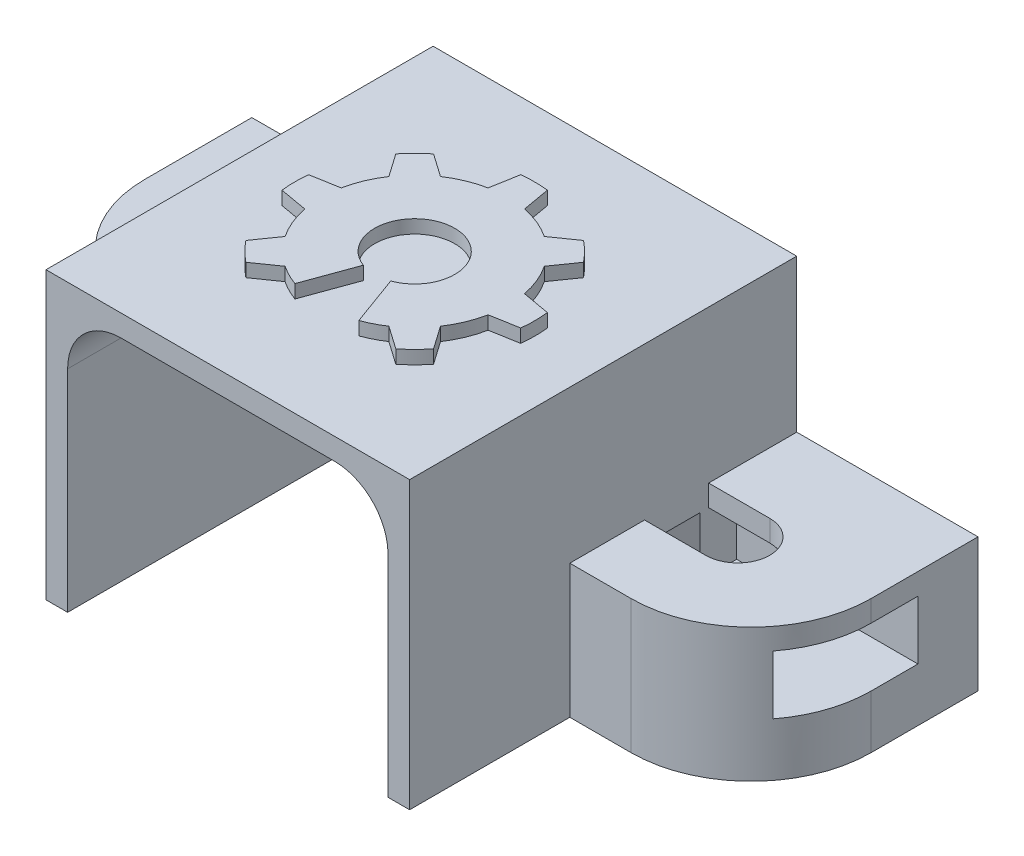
from build123d import *

# Parameters (mm, degrees)
BOSS_EXTRUDE1_DEPTH = 5
FILLET2_R           = 2
BOSS_EXTRUDE3_DEPTH = 9.5
BOSS_EXTRUDE2_DEPTH = 5
CUT_EXTRUDE1_START  = 2
CUT_EXTRUDE1_DEPTH  = 2.2
BOSS_EXTRUDE5_DEPTH = 0.5
SKETCH7_W           = 4.5
SKETCH7_H           = 2.2
CUT_EXTRUDE3_DEPTH  = 6.79
SKETCH8_W           = 4.5
SKETCH8_H           = 2.2
CUT_EXTRUDE4_DEPTH  = 6.79


with BuildPart() as part:
    # Sketch1 → Boss-Extrude1 (new body)
    with BuildSketch(Plane.XY):
        Polygon((6, 0), (6, 9.9), (-6, 9.9), (-6, 0), (-6.81, 0), (-6.81, 10.71), (6.81, 10.71), (6.81, 0), align=None)
    extrude(amount=BOSS_EXTRUDE1_DEPTH)

    # Fillet2
    fillet2_edges = [part.edges().sort_by_distance(p)[0] for p in [
        (6, 9.9, 2.5),
        (-6, 9.9, 2.5),
    ]]
    fillet(fillet2_edges, radius=FILLET2_R)

    # Sketch3 → Boss-Extrude3 (add)
    with BuildSketch(Plane(origin=(0, 0, 0), x_dir=(-1, 0, 0), z_dir=(0, 0, -1))):
        Polygon((6, 0), (6, 9.75), (-6, 9.75), (-6, 0), (-6.81, 0), (-6.81, 10.71), (6.81, 10.71), (6.81, 0), align=None)
    extrude(amount=BOSS_EXTRUDE3_DEPTH)

    # Sketch2 → Boss-Extrude2 (add)
    with BuildSketch(Plane(origin=(0, 0, 0), x_dir=(1, 0, 0), z_dir=(0, 1, 0))):
        with BuildLine():
            Line((6.81, 9.5), (6.81, 6.2))
            Line((6.81, 6.2), (9.1, 6.2))
            ThreePointArc((9.1, 6.2), (10.3, 5), (9.1, 3.8))
            Line((9.1, 3.8), (6.81, 3.8))
            Line((6.81, 3.8), (6.81, 1))
            Line((6.81, 1), (9.1, 1))
            ThreePointArc((9.1, 1), (12.281980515, 2.318019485), (13.6, 5.5))
            Line((13.6, 5.5), (13.6, 9.5))
            Line((13.6, 9.5), (6.81, 9.5))
        make_face()
        with BuildLine():
            Line((-13.6, 9.5), (-13.6, 5.5))
            ThreePointArc((-13.6, 5.5), (-12.281980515, 2.318019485), (-9.1, 1))
            Line((-9.1, 1), (-6.81, 1))
            Line((-6.81, 1), (-6.81, 3.8))
            Line((-6.81, 3.8), (-9.1, 3.8))
            ThreePointArc((-9.1, 3.8), (-10.3, 5), (-9.1, 6.2))
            Line((-9.1, 6.2), (-6.81, 6.2))
            Line((-6.81, 6.2), (-6.81, 9.5))
            Line((-6.81, 9.5), (-13.6, 9.5))
        make_face()
    extrude(amount=BOSS_EXTRUDE2_DEPTH)

    # Sketch4 → Cut-Extrude1 (cut)
    with BuildSketch(Plane(origin=(0, 0, 0), x_dir=(1, 0, 0), z_dir=(0, 1, 0)).offset(CUT_EXTRUDE1_START)):
        Polygon((10.199038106, 7.25), (7.600961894, 7.25), (6.301923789, 5), (7.600961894, 2.75), (10.199038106, 2.75), (11.498076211, 5), align=None)
    cut_extrude1 = extrude(amount=CUT_EXTRUDE1_DEPTH, mode=Mode.SUBTRACT)

    # Mirror2: Cut-Extrude1 across plane
    add(cut_extrude1.mirror(Plane(origin=(0, 0, 0), x_dir=(0, 0, 1), z_dir=(1, 0, 0))), mode=Mode.SUBTRACT)

    # Sketch6 → Boss-Extrude5 (add)
    with BuildSketch(Plane(origin=(0, 10.71, 0), x_dir=(1, 0, 0), z_dir=(0, 1, 0))):
        with BuildLine():
            Line((0.513030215, 0.590461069), (1.197070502, -1.288924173))
            ThreePointArc((1.197070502, -1.288924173), (1.58194454, -1.122090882), (1.94409522, -0.910411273))
            Line((1.94409522, -0.910411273), (2.80872427, -1.515831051))
            ThreePointArc((2.80872427, -1.515831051), (3.181980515, -1.181980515), (3.515831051, -0.80872427))
            Line((3.515831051, -0.80872427), (2.910411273, 0.05590478))
            ThreePointArc((2.910411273, 0.05590478), (3.233578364, 0.660607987), (3.43265446, 1.316711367))
            Line((3.43265446, 1.316711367), (4.472135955, 1.5))
            ThreePointArc((4.472135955, 1.5), (4.5, 2), (4.472135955, 2.5))
            Line((4.472135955, 2.5), (3.43265446, 2.683288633))
            ThreePointArc((3.43265446, 2.683288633), (3.233578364, 3.339392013), (2.910411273, 3.94409522))
            Line((2.910411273, 3.94409522), (3.515831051, 4.80872427))
            ThreePointArc((3.515831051, 4.80872427), (3.181980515, 5.181980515), (2.80872427, 5.515831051))
            Line((2.80872427, 5.515831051), (1.94409522, 4.910411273))
            ThreePointArc((1.94409522, 4.910411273), (1.339392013, 5.233578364), (0.683288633, 5.43265446))
            Line((0.683288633, 5.43265446), (0.5, 6.472135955))
            ThreePointArc((0.5, 6.472135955), (0, 6.5), (-0.5, 6.472135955))
            Line((-0.5, 6.472135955), (-0.683288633, 5.43265446))
            ThreePointArc((-0.683288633, 5.43265446), (-1.339392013, 5.233578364), (-1.94409522, 4.910411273))
            Line((-1.94409522, 4.910411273), (-2.80872427, 5.515831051))
            ThreePointArc((-2.80872427, 5.515831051), (-3.181980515, 5.181980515), (-3.515831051, 4.80872427))
            Line((-3.515831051, 4.80872427), (-2.910411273, 3.94409522))
            ThreePointArc((-2.910411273, 3.94409522), (-3.233578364, 3.339392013), (-3.43265446, 2.683288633))
            Line((-3.43265446, 2.683288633), (-4.472135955, 2.5))
            ThreePointArc((-4.472135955, 2.5), (-4.5, 2), (-4.472135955, 1.5))
            Line((-4.472135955, 1.5), (-3.43265446, 1.316711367))
            ThreePointArc((-3.43265446, 1.316711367), (-3.233578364, 0.660607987), (-2.910411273, 0.05590478))
            Line((-2.910411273, 0.05590478), (-3.515831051, -0.80872427))
            ThreePointArc((-3.515831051, -0.80872427), (-3.181980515, -1.181980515), (-2.80872427, -1.515831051))
            Line((-2.80872427, -1.515831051), (-1.94409522, -0.910411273))
            ThreePointArc((-1.94409522, -0.910411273), (-1.58194454, -1.122090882), (-1.197070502, -1.288924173))
            Line((-1.197070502, -1.288924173), (-0.513030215, 0.590461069))
            ThreePointArc((-0.513030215, 0.590461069), (0, 3.5), (0.513030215, 0.590461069))
        make_face()
    extrude(amount=BOSS_EXTRUDE5_DEPTH)

    # Sketch7 → Cut-Extrude3 (cut)
    with BuildSketch(Plane(origin=(13.6, 0, 0), x_dir=(0, 0, -1), z_dir=(1, 0, 0))):
        with Locations((5, 3.1)):
            Rectangle(SKETCH7_W, SKETCH7_H)
    extrude(amount=-CUT_EXTRUDE3_DEPTH, mode=Mode.SUBTRACT)

    # Sketch8 → Cut-Extrude4 (cut)
    with BuildSketch(Plane.ZY.offset(13.6)):
        with Locations((-5, 3.1)):
            Rectangle(SKETCH8_W, SKETCH8_H)
    extrude(amount=-CUT_EXTRUDE4_DEPTH, mode=Mode.SUBTRACT)


solid = part.part
